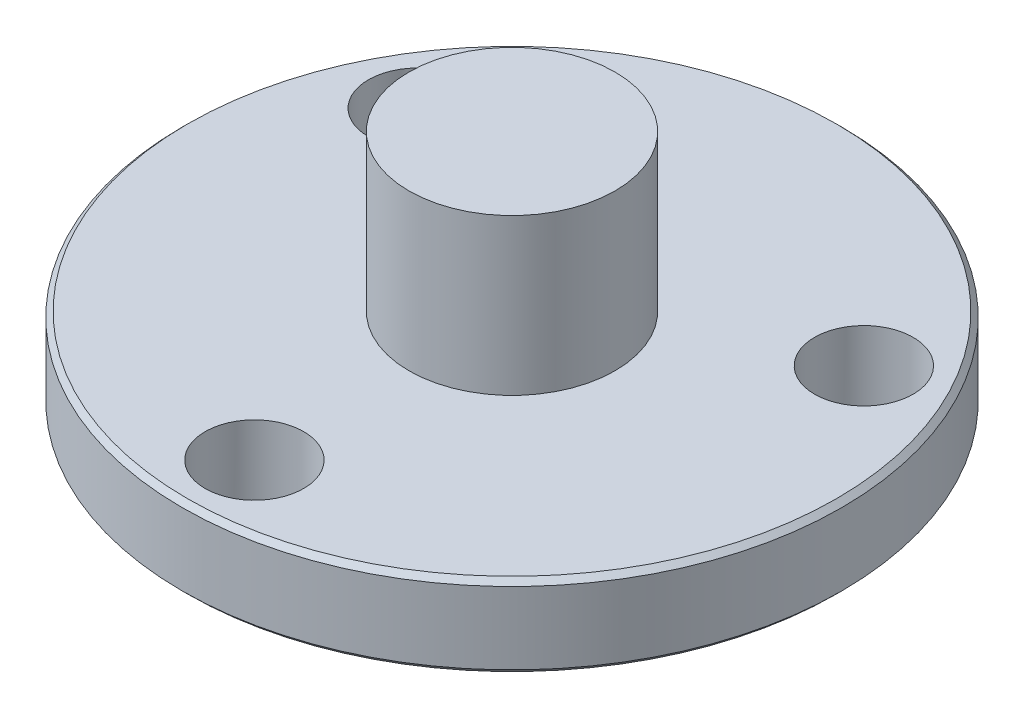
from build123d import *

# Parameters (mm, degrees)
SKETCH1_R           = 3.96875
BOSS_EXTRUDE1_DEPTH = 70
BOSS_EXTRUDE2_START = -15.31875
SKETCH2_R           = 12.7
BOSS_EXTRUDE2_DEPTH = 3.18
CHAMFER1_SIZE       = 0.2
CHAMFER2_SIZE       = 0.2
CHAMFER3_SIZE       = 0.2
CIRPATTERN1_COUNT   = 3
SKETCH11_R          = 12.5
CUT_EXTRUDE1_DEPTH  = 58.555356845
CUT_EXTRUDE2_START  = 6
SKETCH12_R          = 12.5
CUT_EXTRUDE2_DEPTH  = 49.543182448


with BuildPart() as part:
    # Sketch1 → Boss-Extrude1 (new body)
    with BuildSketch(Plane(origin=(0, 0, 0), x_dir=(1, 0, 0), z_dir=(0, 1, 0))):
        with Locations(Location((0, 0, 0), (0, 0, 270))):
            Circle(SKETCH1_R)
    extrude(amount=BOSS_EXTRUDE1_DEPTH)

    # Sketch2 → Boss-Extrude2 (add)
    with BuildSketch(Plane.XZ.offset(BOSS_EXTRUDE2_START)):
        with Locations(Location((0, 0, 0), (0, 0, 270))):
            Circle(SKETCH2_R)
    extrude(amount=-BOSS_EXTRUDE2_DEPTH)

    # Chamfer1
    chamfer1_edges = [part.edges().sort_by_distance(p)[0] for p in [
        (0, 18.49875, 12.7),
    ]]
    chamfer(chamfer1_edges, length=CHAMFER1_SIZE)

    # Chamfer2
    chamfer2_edges = [part.edges().sort_by_distance(p)[0] for p in [
        (0, 15.31875, 12.7),
    ]]
    chamfer(chamfer2_edges, length=CHAMFER2_SIZE)

    # Chamfer3
    chamfer3_edges = [part.edges().sort_by_distance(p)[0] for p in [
        (0, 70, -3.96875),
    ]]
    chamfer(chamfer3_edges, length=CHAMFER3_SIZE)

    # Sketch9 → 6 Clearance Hole1 (revolve, cut)
    with BuildSketch(Plane(origin=(0, 18.49875, 9.921875), x_dir=(0, 0, 1), z_dir=(1, 0, 0))):
        Polygon((0, 0), (0, 10.140824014), (1.89865, 9), (1.89865, 0), align=None)
    f_6_clearance_hole1 = revolve(axis=Axis((0, 24.84875, 9.921875), (0, -1, 0)), mode=Mode.SUBTRACT)

    # CirPattern1: 6 Clearance Hole1 ×3 about axis
    cirpattern1_axis = Axis((0, 0, 0), (0, 1, 0))
    for i in range(1, CIRPATTERN1_COUNT):
        add(f_6_clearance_hole1.rotate(cirpattern1_axis, i * 360 / CIRPATTERN1_COUNT), mode=Mode.SUBTRACT)

    # Sketch11 → Cut-Extrude1 (cut, through all)
    with BuildSketch(Plane.XZ.offset(-15.31875)):
        Circle(SKETCH11_R)
    extrude(amount=CUT_EXTRUDE1_DEPTH, mode=Mode.SUBTRACT)

    # Sketch12 → Cut-Extrude2 (cut, through all)
    with BuildSketch(Plane(origin=(0, 18.49875, 0), x_dir=(1, 0, 0), z_dir=(0, 1, 0)).offset(CUT_EXTRUDE2_START)):
        Circle(SKETCH12_R)
    extrude(amount=CUT_EXTRUDE2_DEPTH, mode=Mode.SUBTRACT)


solid = part.part
